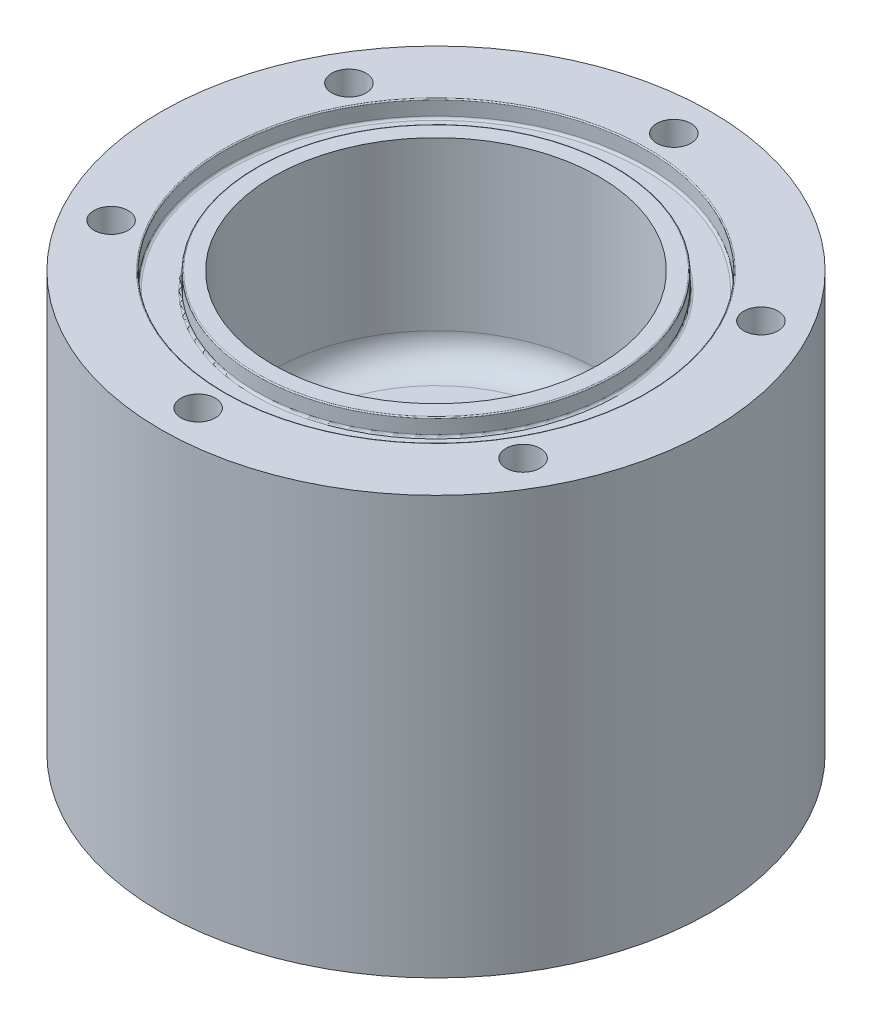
from build123d import *

# Parameters (mm, degrees)
SKETCH2_R          = 0.9652
CUT_EXTRUDE1_DEPTH = 52.099871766
CIRPATTERN1_COUNT  = 6
SKETCH3_R          = 1.9558
CUT_EXTRUDE2_DEPTH = 66.070558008
CIRPATTERN2_COUNT  = 6


with BuildPart() as part:
    # Sketch1 → Base-Revolve (revolve)
    with BuildSketch(Plane.XY, mode=Mode.PRIVATE) as base_revolve_sk:
        with BuildLine():
            Line((31.353125, 9.525), (31.353125, 57.15))
            Line((31.353125, 57.15), (24.13, 57.15))
            ThreePointArc((24.13, 57.15), (24.040197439, 57.112802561), (24.003, 57.023))
            Line((24.003, 57.023), (24.003, 55.4482))
            ThreePointArc((24.003, 55.4482), (23.928605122, 55.268594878), (23.749, 55.1942))
            Line((23.749, 55.1942), (20.7264, 55.1942))
            ThreePointArc((20.7264, 55.1942), (20.546794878, 55.268594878), (20.4724, 55.4482))
            Line((20.4724, 55.4482), (20.4724, 57.023))
            ThreePointArc((20.4724, 57.023), (20.435202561, 57.112802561), (20.3454, 57.15))
            Line((20.3454, 57.15), (18.5674, 57.15))
            Line((18.5674, 57.15), (18.5674, 38.1))
            ThreePointArc((18.5674, 38.1), (17.63746403, 35.85493597), (15.3924, 34.925))
            Line((15.3924, 34.925), (0, 34.925))
            Line((0, 34.925), (0, 28.575))
            Line((0, 28.575), (11.1125, 28.575))
            Line((11.1125, 28.575), (11.1125, 9.525))
            Line((11.1125, 9.525), (31.353125, 9.525))
        make_face()
    revolve(base_revolve_sk.sketch.rotate(Axis((0, 71.486597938, 0), (0, -1, 0)), 90), axis=Axis((0, 71.486597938, 0), (0, -1, 0)))

    # Sketch2 → Cut-Extrude1 (cut, through all)
    with BuildSketch(Plane(origin=(0, 34.925, 0), x_dir=(-1, 0, 0), z_dir=(0, 1, 0))):
        with Locations(Location((0, 0, 0), (0, 0, 90))):
            Circle(SKETCH2_R)
        with Locations(Location((0, 7.9375, 0), (0, 0, 90))):
            Circle(SKETCH2_R)
    cut_extrude1 = extrude(amount=-CUT_EXTRUDE1_DEPTH, mode=Mode.SUBTRACT)

    # CirPattern1: Cut-Extrude1 ×6 about axis
    cirpattern1_axis = Axis((0, 71.486597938, 0), (0, -1, 0))
    for i in range(1, CIRPATTERN1_COUNT):
        add(cut_extrude1.rotate(cirpattern1_axis, i * 360 / CIRPATTERN1_COUNT), mode=Mode.SUBTRACT)

    # Sketch3 → Cut-Extrude2 (cut, through all)
    with BuildSketch(Plane(origin=(0, 57.15, 0), x_dir=(-1, 0, 0), z_dir=(0, 1, 0))):
        with Locations(Location((0, 27.1018, 0), (0, 0, 90))):
            Circle(SKETCH3_R)
    cut_extrude2 = extrude(amount=-CUT_EXTRUDE2_DEPTH, mode=Mode.SUBTRACT)

    # CirPattern2: Cut-Extrude2 ×6 about axis
    cirpattern2_axis = Axis((0, 71.486597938, 0), (0, -1, 0))
    for i in range(1, CIRPATTERN2_COUNT):
        add(cut_extrude2.rotate(cirpattern2_axis, i * 360 / CIRPATTERN2_COUNT), mode=Mode.SUBTRACT)


solid = part.part
